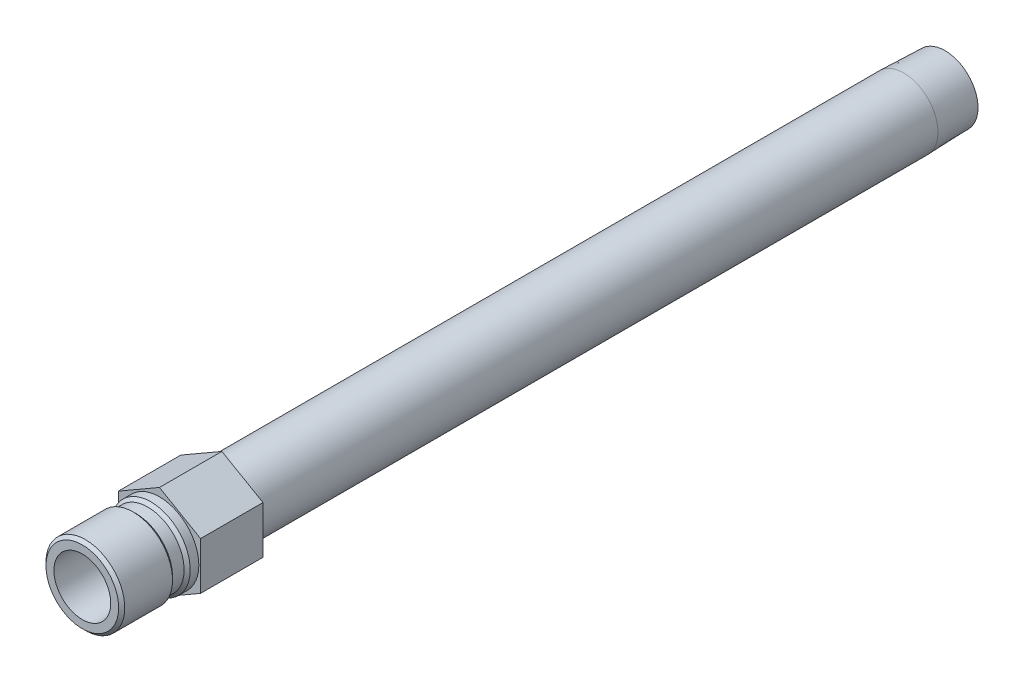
from build123d import *

# Parameters (mm, degrees)
SKETCH2_R           = 7.112
BOSS_EXTRUDE1_DEPTH = 15.621


with BuildPart() as part:
    # Sketch1 → Revolve1 (revolve)
    with BuildSketch(Plane(origin=(0, 0, 0), x_dir=(0, 0, -1), z_dir=(1, 0, 0))):
        Polygon((-19.304, 7.112), (-19.304, 9.0932), (-18.542, 9.8552), (-6.5786, 9.8552), (-5.8166, 9.0932), (-2.921, 9.0932), (-2.159, 9.8552), (0, 9.8552), (0, 8.5725), (186.2582, 8.5725), (196.596, 8.249445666), (196.596, 6.2611), (-1.071568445, 6.2611), (-1.524, 7.112), align=None)
    revolve(axis=Axis((0, 0, 0), (0, 0, 1)))

    # Sketch2 → Boss-Extrude1 (add)
    with BuildSketch(Plane.XY):
        Polygon((-10.287, 5.939202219), (-10.287, -5.939202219), (0, -11.878404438), (10.287, -5.939202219), (10.287, 5.939202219), (0, 11.878404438), align=None)
        with Locations(Location((0, 0, 0), (0, 0, 90))):
            Circle(SKETCH2_R, mode=Mode.SUBTRACT)
    extrude(amount=-BOSS_EXTRUDE1_DEPTH)


solid = part.part
